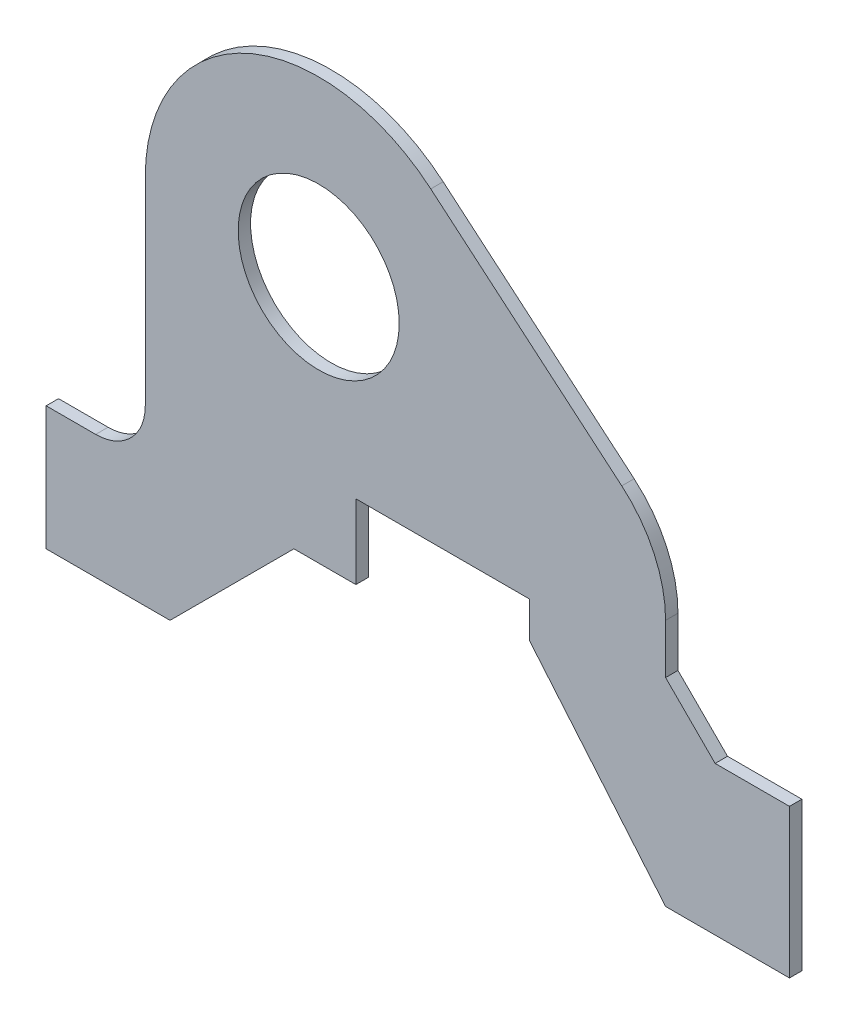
ISO-10303-21;
HEADER;
FILE_DESCRIPTION(('STEP AP214'),'2;1');
FILE_NAME('part.step','',(''),(''),'','','');
FILE_SCHEMA(('AUTOMOTIVE_DESIGN { 1 0 10303 214 1 1 1 1 }'));
ENDSEC;
DATA;
#1=APPLICATION_CONTEXT('core data for automotive mechanical design processes');
#2=APPLICATION_PROTOCOL_DEFINITION('international standard','automotive_design',2000,#1);
#3=PRODUCT_CONTEXT('',#1,'mechanical');
#4=PRODUCT('Part','Part','',(#3));
#5=PRODUCT_RELATED_PRODUCT_CATEGORY('part','',(#4));
#6=PRODUCT_DEFINITION_FORMATION('','',#4);
#7=PRODUCT_DEFINITION_CONTEXT('part definition',#1,'design');
#8=PRODUCT_DEFINITION('design','',#6,#7);
#9=PRODUCT_DEFINITION_SHAPE('','',#8);
#10=(LENGTH_UNIT() NAMED_UNIT(*) SI_UNIT(.MILLI.,.METRE.));
#11=(NAMED_UNIT(*) PLANE_ANGLE_UNIT() SI_UNIT($,.RADIAN.));
#12=(NAMED_UNIT(*) SI_UNIT($,.STERADIAN.) SOLID_ANGLE_UNIT());
#13=UNCERTAINTY_MEASURE_WITH_UNIT(LENGTH_MEASURE(1.E-05),#10,'distance_accuracy_value','');
#14=(GEOMETRIC_REPRESENTATION_CONTEXT(3) GLOBAL_UNCERTAINTY_ASSIGNED_CONTEXT((#13)) GLOBAL_UNIT_ASSIGNED_CONTEXT((#10,
#11,#12)) REPRESENTATION_CONTEXT('',''));
#15=CARTESIAN_POINT('',(0.,0.,0.));
#16=DIRECTION('',(0.,0.,1.));
#17=DIRECTION('',(1.,0.,0.));
#18=AXIS2_PLACEMENT_3D('',#15,#16,#17);
#19=CARTESIAN_POINT('',(4.,14.,1.));
#20=DIRECTION('',(0.,0.,1.));
#21=DIRECTION('',(1.,0.,0.));
#22=AXIS2_PLACEMENT_3D('',#19,#20,#21);
#23=PLANE('',#22);
#24=DIRECTION('',(1.,0.,0.));
#25=VECTOR('',#24,1.);
#26=CARTESIAN_POINT('',(10.,0.,1.));
#27=LINE('',#26,#25);
#28=CARTESIAN_POINT('',(0.,0.,1.));
#29=VERTEX_POINT('',#28);
#30=CARTESIAN_POINT('',(10.,0.,1.));
#31=VERTEX_POINT('',#30);
#32=EDGE_CURVE('E233',#29,#31,#27,.T.);
#33=ORIENTED_EDGE('',*,*,#32,.T.);
#34=DIRECTION('',(0.707106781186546,0.707106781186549,0.));
#35=VECTOR('',#34,1.);
#36=CARTESIAN_POINT('',(20.,10.,1.));
#37=LINE('',#36,#35);
#38=CARTESIAN_POINT('',(20.,10.,1.));
#39=VERTEX_POINT('',#38);
#40=EDGE_CURVE('E126',#31,#39,#37,.T.);
#41=ORIENTED_EDGE('',*,*,#40,.T.);
#42=DIRECTION('',(1.,0.,0.));
#43=VECTOR('',#42,1.);
#44=CARTESIAN_POINT('',(20.,10.,1.));
#45=LINE('',#44,#43);
#46=CARTESIAN_POINT('',(25.,10.,1.));
#47=VERTEX_POINT('',#46);
#48=EDGE_CURVE('E281',#39,#47,#45,.T.);
#49=ORIENTED_EDGE('',*,*,#48,.T.);
#50=DIRECTION('',(0.,1.,0.));
#51=VECTOR('',#50,1.);
#52=CARTESIAN_POINT('',(25.,10.,1.));
#53=LINE('',#52,#51);
#54=CARTESIAN_POINT('',(25.,16.,1.));
#55=VERTEX_POINT('',#54);
#56=EDGE_CURVE('E300',#47,#55,#53,.T.);
#57=ORIENTED_EDGE('',*,*,#56,.T.);
#58=DIRECTION('',(1.,0.,0.));
#59=VECTOR('',#58,1.);
#60=CARTESIAN_POINT('',(25.,16.,1.));
#61=LINE('',#60,#59);
#62=CARTESIAN_POINT('',(39.,16.,1.));
#63=VERTEX_POINT('',#62);
#64=EDGE_CURVE('E297',#55,#63,#61,.T.);
#65=ORIENTED_EDGE('',*,*,#64,.T.);
#66=DIRECTION('',(0.,-1.,0.));
#67=VECTOR('',#66,1.);
#68=CARTESIAN_POINT('',(39.,16.,1.));
#69=LINE('',#68,#67);
#70=CARTESIAN_POINT('',(39.,13.1092895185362,1.));
#71=VERTEX_POINT('',#70);
#72=EDGE_CURVE('E299',#63,#71,#69,.T.);
#73=ORIENTED_EDGE('',*,*,#72,.T.);
#74=DIRECTION('',(0.642787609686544,-0.766044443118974,0.));
#75=VECTOR('',#74,1.);
#76=CARTESIAN_POINT('',(39.,13.1092895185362,1.));
#77=LINE('',#76,#75);
#78=CARTESIAN_POINT('',(50.,0.,1.));
#79=VERTEX_POINT('',#78);
#80=EDGE_CURVE('E302',#71,#79,#77,.T.);
#81=ORIENTED_EDGE('',*,*,#80,.T.);
#82=DIRECTION('',(1.,0.,0.));
#83=VECTOR('',#82,1.);
#84=CARTESIAN_POINT('',(60.,0.,1.));
#85=LINE('',#84,#83);
#86=CARTESIAN_POINT('',(60.,0.,1.));
#87=VERTEX_POINT('',#86);
#88=EDGE_CURVE('E308',#79,#87,#85,.T.);
#89=ORIENTED_EDGE('',*,*,#88,.T.);
#90=DIRECTION('',(0.,1.,0.));
#91=VECTOR('',#90,1.);
#92=CARTESIAN_POINT('',(60.,12.,1.));
#93=LINE('',#92,#91);
#94=CARTESIAN_POINT('',(60.,12.,1.));
#95=VERTEX_POINT('',#94);
#96=EDGE_CURVE('E310',#87,#95,#93,.T.);
#97=ORIENTED_EDGE('',*,*,#96,.T.);
#98=DIRECTION('',(-1.,0.,0.));
#99=VECTOR('',#98,1.);
#100=CARTESIAN_POINT('',(54.,12.,1.));
#101=LINE('',#100,#99);
#102=CARTESIAN_POINT('',(54.,12.,1.));
#103=VERTEX_POINT('',#102);
#104=EDGE_CURVE('E312',#95,#103,#101,.T.);
#105=ORIENTED_EDGE('',*,*,#104,.T.);
#106=DIRECTION('',(-0.707106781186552,0.707106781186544,0.));
#107=VECTOR('',#106,1.);
#108=CARTESIAN_POINT('',(54.,12.,1.));
#109=LINE('',#108,#107);
#110=CARTESIAN_POINT('',(50.,16.,1.));
#111=VERTEX_POINT('',#110);
#112=EDGE_CURVE('E314',#103,#111,#109,.T.);
#113=ORIENTED_EDGE('',*,*,#112,.T.);
#114=DIRECTION('',(0.,1.,0.));
#115=VECTOR('',#114,1.);
#116=CARTESIAN_POINT('',(50.,16.,1.));
#117=LINE('',#116,#115);
#118=CARTESIAN_POINT('',(50.,20.,1.));
#119=VERTEX_POINT('',#118);
#120=EDGE_CURVE('E316',#111,#119,#117,.T.);
#121=ORIENTED_EDGE('',*,*,#120,.T.);
#122=CARTESIAN_POINT('',(40.,20.,1.));
#123=DIRECTION('',(0.,0.,1.));
#124=DIRECTION('',(1.,0.,0.));
#125=AXIS2_PLACEMENT_3D('',#122,#123,#124);
#126=CIRCLE('',#125,10.);
#127=CARTESIAN_POINT('',(46.4620306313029,27.6316551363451,1.));
#128=VERTEX_POINT('',#127);
#129=EDGE_CURVE('E318',#119,#128,#126,.T.);
#130=ORIENTED_EDGE('',*,*,#129,.T.);
#131=DIRECTION('',(-0.763165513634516,0.646203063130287,0.));
#132=VECTOR('',#131,1.);
#133=CARTESIAN_POINT('',(31.046842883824,40.6843171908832,1.));
#134=LINE('',#133,#132);
#135=CARTESIAN_POINT('',(31.046842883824,40.6843171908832,1.));
#136=VERTEX_POINT('',#135);
#137=EDGE_CURVE('E320',#128,#136,#134,.T.);
#138=ORIENTED_EDGE('',*,*,#137,.T.);
#139=CARTESIAN_POINT('',(22.,30.,1.));
#140=DIRECTION('',(0.,0.,1.));
#141=DIRECTION('',(-1.,0.,0.));
#142=AXIS2_PLACEMENT_3D('',#139,#140,#141);
#143=CIRCLE('',#142,14.);
#144=CARTESIAN_POINT('',(8.,30.,1.));
#145=VERTEX_POINT('',#144);
#146=EDGE_CURVE('E322',#136,#145,#143,.T.);
#147=ORIENTED_EDGE('',*,*,#146,.T.);
#148=DIRECTION('',(0.,-1.,0.));
#149=VECTOR('',#148,1.);
#150=CARTESIAN_POINT('',(8.,14.,1.));
#151=LINE('',#150,#149);
#152=CARTESIAN_POINT('',(8.,14.,1.));
#153=VERTEX_POINT('',#152);
#154=EDGE_CURVE('E178',#145,#153,#151,.T.);
#155=ORIENTED_EDGE('',*,*,#154,.T.);
#156=CARTESIAN_POINT('',(4.,14.,1.));
#157=DIRECTION('',(0.,0.,-1.));
#158=DIRECTION('',(1.,0.,0.));
#159=AXIS2_PLACEMENT_3D('',#156,#157,#158);
#160=CIRCLE('',#159,4.);
#161=CARTESIAN_POINT('',(4.,10.,1.));
#162=VERTEX_POINT('',#161);
#163=EDGE_CURVE('E172',#153,#162,#160,.T.);
#164=ORIENTED_EDGE('',*,*,#163,.T.);
#165=DIRECTION('',(-1.,0.,0.));
#166=VECTOR('',#165,1.);
#167=CARTESIAN_POINT('',(0.,10.,1.));
#168=LINE('',#167,#166);
#169=CARTESIAN_POINT('',(0.,10.,1.));
#170=VERTEX_POINT('',#169);
#171=EDGE_CURVE('E176',#162,#170,#168,.T.);
#172=ORIENTED_EDGE('',*,*,#171,.T.);
#173=DIRECTION('',(0.,-1.,0.));
#174=VECTOR('',#173,1.);
#175=CARTESIAN_POINT('',(0.,0.,1.));
#176=LINE('',#175,#174);
#177=EDGE_CURVE('E50',#170,#29,#176,.T.);
#178=ORIENTED_EDGE('',*,*,#177,.T.);
#179=EDGE_LOOP('',(#33,#41,#49,#57,#65,#73,#81,#89,#97,#105,#113,#121,#130,#138,#147,#155,#164,
#172,#178));
#180=FACE_BOUND('',#179,.T.);
#181=CARTESIAN_POINT('',(22.,30.,1.));
#182=DIRECTION('',(0.,0.,1.));
#183=DIRECTION('',(1.,0.,0.));
#184=AXIS2_PLACEMENT_3D('',#181,#182,#183);
#185=CIRCLE('',#184,6.50000000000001);
#186=CARTESIAN_POINT('',(28.5,30.,1.));
#187=VERTEX_POINT('',#186);
#188=EDGE_CURVE('E200',#187,#187,#185,.T.);
#189=ORIENTED_EDGE('',*,*,#188,.F.);
#190=EDGE_LOOP('',(#189));
#191=FACE_BOUND('',#190,.T.);
#192=ADVANCED_FACE('F33',(#180,#191),#23,.T.);
#193=CARTESIAN_POINT('',(4.,14.,0.));
#194=DIRECTION('',(0.,0.,1.));
#195=DIRECTION('',(1.,0.,0.));
#196=AXIS2_PLACEMENT_3D('',#193,#194,#195);
#197=PLANE('',#196);
#198=DIRECTION('',(1.,0.,0.));
#199=VECTOR('',#198,1.);
#200=CARTESIAN_POINT('',(10.,0.,0.));
#201=LINE('',#200,#199);
#202=CARTESIAN_POINT('',(0.,0.,0.));
#203=VERTEX_POINT('',#202);
#204=CARTESIAN_POINT('',(10.,0.,0.));
#205=VERTEX_POINT('',#204);
#206=EDGE_CURVE('E196',#203,#205,#201,.T.);
#207=ORIENTED_EDGE('',*,*,#206,.F.);
#208=DIRECTION('',(0.,-1.,0.));
#209=VECTOR('',#208,1.);
#210=CARTESIAN_POINT('',(0.,0.,0.));
#211=LINE('',#210,#209);
#212=CARTESIAN_POINT('',(0.,10.,0.));
#213=VERTEX_POINT('',#212);
#214=EDGE_CURVE('E118',#213,#203,#211,.T.);
#215=ORIENTED_EDGE('',*,*,#214,.F.);
#216=DIRECTION('',(-1.,0.,0.));
#217=VECTOR('',#216,1.);
#218=CARTESIAN_POINT('',(0.,10.,0.));
#219=LINE('',#218,#217);
#220=CARTESIAN_POINT('',(4.,10.,0.));
#221=VERTEX_POINT('',#220);
#222=EDGE_CURVE('E112',#221,#213,#219,.T.);
#223=ORIENTED_EDGE('',*,*,#222,.F.);
#224=CARTESIAN_POINT('',(4.,14.,0.));
#225=DIRECTION('',(0.,0.,-1.));
#226=DIRECTION('',(1.,0.,0.));
#227=AXIS2_PLACEMENT_3D('',#224,#225,#226);
#228=CIRCLE('',#227,4.);
#229=CARTESIAN_POINT('',(8.,14.,0.));
#230=VERTEX_POINT('',#229);
#231=EDGE_CURVE('E186',#230,#221,#228,.T.);
#232=ORIENTED_EDGE('',*,*,#231,.F.);
#233=DIRECTION('',(0.,-1.,0.));
#234=VECTOR('',#233,1.);
#235=CARTESIAN_POINT('',(8.,14.,0.));
#236=LINE('',#235,#234);
#237=CARTESIAN_POINT('',(8.,30.,0.));
#238=VERTEX_POINT('',#237);
#239=EDGE_CURVE('E228',#238,#230,#236,.T.);
#240=ORIENTED_EDGE('',*,*,#239,.F.);
#241=CARTESIAN_POINT('',(22.,30.,0.));
#242=DIRECTION('',(0.,0.,1.));
#243=DIRECTION('',(-1.,0.,0.));
#244=AXIS2_PLACEMENT_3D('',#241,#242,#243);
#245=CIRCLE('',#244,14.);
#246=CARTESIAN_POINT('',(31.046842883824,40.6843171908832,0.));
#247=VERTEX_POINT('',#246);
#248=EDGE_CURVE('E226',#247,#238,#245,.T.);
#249=ORIENTED_EDGE('',*,*,#248,.F.);
#250=DIRECTION('',(-0.763165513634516,0.646203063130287,0.));
#251=VECTOR('',#250,1.);
#252=CARTESIAN_POINT('',(31.046842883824,40.6843171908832,0.));
#253=LINE('',#252,#251);
#254=CARTESIAN_POINT('',(46.4620306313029,27.6316551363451,0.));
#255=VERTEX_POINT('',#254);
#256=EDGE_CURVE('E224',#255,#247,#253,.T.);
#257=ORIENTED_EDGE('',*,*,#256,.F.);
#258=CARTESIAN_POINT('',(40.,20.,0.));
#259=DIRECTION('',(0.,0.,1.));
#260=DIRECTION('',(1.,0.,0.));
#261=AXIS2_PLACEMENT_3D('',#258,#259,#260);
#262=CIRCLE('',#261,10.);
#263=CARTESIAN_POINT('',(50.,20.,0.));
#264=VERTEX_POINT('',#263);
#265=EDGE_CURVE('E222',#264,#255,#262,.T.);
#266=ORIENTED_EDGE('',*,*,#265,.F.);
#267=DIRECTION('',(0.,1.,0.));
#268=VECTOR('',#267,1.);
#269=CARTESIAN_POINT('',(50.,16.,0.));
#270=LINE('',#269,#268);
#271=CARTESIAN_POINT('',(50.,16.,0.));
#272=VERTEX_POINT('',#271);
#273=EDGE_CURVE('E220',#272,#264,#270,.T.);
#274=ORIENTED_EDGE('',*,*,#273,.F.);
#275=DIRECTION('',(-0.707106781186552,0.707106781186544,0.));
#276=VECTOR('',#275,1.);
#277=CARTESIAN_POINT('',(54.,12.,0.));
#278=LINE('',#277,#276);
#279=CARTESIAN_POINT('',(54.,12.,0.));
#280=VERTEX_POINT('',#279);
#281=EDGE_CURVE('E218',#280,#272,#278,.T.);
#282=ORIENTED_EDGE('',*,*,#281,.F.);
#283=DIRECTION('',(-1.,0.,0.));
#284=VECTOR('',#283,1.);
#285=CARTESIAN_POINT('',(54.,12.,0.));
#286=LINE('',#285,#284);
#287=CARTESIAN_POINT('',(60.,12.,0.));
#288=VERTEX_POINT('',#287);
#289=EDGE_CURVE('E216',#288,#280,#286,.T.);
#290=ORIENTED_EDGE('',*,*,#289,.F.);
#291=DIRECTION('',(0.,1.,0.));
#292=VECTOR('',#291,1.);
#293=CARTESIAN_POINT('',(60.,12.,0.));
#294=LINE('',#293,#292);
#295=CARTESIAN_POINT('',(60.,0.,0.));
#296=VERTEX_POINT('',#295);
#297=EDGE_CURVE('E214',#296,#288,#294,.T.);
#298=ORIENTED_EDGE('',*,*,#297,.F.);
#299=DIRECTION('',(1.,0.,0.));
#300=VECTOR('',#299,1.);
#301=CARTESIAN_POINT('',(60.,0.,0.));
#302=LINE('',#301,#300);
#303=CARTESIAN_POINT('',(50.,0.,0.));
#304=VERTEX_POINT('',#303);
#305=EDGE_CURVE('E212',#304,#296,#302,.T.);
#306=ORIENTED_EDGE('',*,*,#305,.F.);
#307=DIRECTION('',(0.642787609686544,-0.766044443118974,0.));
#308=VECTOR('',#307,1.);
#309=CARTESIAN_POINT('',(39.,13.1092895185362,0.));
#310=LINE('',#309,#308);
#311=CARTESIAN_POINT('',(39.,13.1092895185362,0.));
#312=VERTEX_POINT('',#311);
#313=EDGE_CURVE('E210',#312,#304,#310,.T.);
#314=ORIENTED_EDGE('',*,*,#313,.F.);
#315=DIRECTION('',(0.,-1.,0.));
#316=VECTOR('',#315,1.);
#317=CARTESIAN_POINT('',(39.,16.,0.));
#318=LINE('',#317,#316);
#319=CARTESIAN_POINT('',(39.,16.,0.));
#320=VERTEX_POINT('',#319);
#321=EDGE_CURVE('E208',#320,#312,#318,.T.);
#322=ORIENTED_EDGE('',*,*,#321,.F.);
#323=DIRECTION('',(1.,0.,0.));
#324=VECTOR('',#323,1.);
#325=CARTESIAN_POINT('',(25.,16.,0.));
#326=LINE('',#325,#324);
#327=CARTESIAN_POINT('',(25.,16.,0.));
#328=VERTEX_POINT('',#327);
#329=EDGE_CURVE('E206',#328,#320,#326,.T.);
#330=ORIENTED_EDGE('',*,*,#329,.F.);
#331=DIRECTION('',(0.,1.,0.));
#332=VECTOR('',#331,1.);
#333=CARTESIAN_POINT('',(25.,10.,0.));
#334=LINE('',#333,#332);
#335=CARTESIAN_POINT('',(25.,10.,0.));
#336=VERTEX_POINT('',#335);
#337=EDGE_CURVE('E204',#336,#328,#334,.T.);
#338=ORIENTED_EDGE('',*,*,#337,.F.);
#339=DIRECTION('',(1.,0.,0.));
#340=VECTOR('',#339,1.);
#341=CARTESIAN_POINT('',(20.,10.,0.));
#342=LINE('',#341,#340);
#343=CARTESIAN_POINT('',(20.,10.,0.));
#344=VERTEX_POINT('',#343);
#345=EDGE_CURVE('E202',#344,#336,#342,.T.);
#346=ORIENTED_EDGE('',*,*,#345,.F.);
#347=DIRECTION('',(0.707106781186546,0.707106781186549,0.));
#348=VECTOR('',#347,1.);
#349=CARTESIAN_POINT('',(20.,10.,0.));
#350=LINE('',#349,#348);
#351=EDGE_CURVE('E199',#205,#344,#350,.T.);
#352=ORIENTED_EDGE('',*,*,#351,.F.);
#353=EDGE_LOOP('',(#207,#215,#223,#232,#240,#249,#257,#266,#274,#282,#290,#298,#306,#314,#322,
#330,#338,#346,#352));
#354=FACE_BOUND('',#353,.T.);
#355=CARTESIAN_POINT('',(22.,30.,0.));
#356=DIRECTION('',(0.,0.,1.));
#357=DIRECTION('',(1.,0.,0.));
#358=AXIS2_PLACEMENT_3D('',#355,#356,#357);
#359=CIRCLE('',#358,6.50000000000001);
#360=CARTESIAN_POINT('',(28.5,30.,0.));
#361=VERTEX_POINT('',#360);
#362=EDGE_CURVE('E560',#361,#361,#359,.T.);
#363=ORIENTED_EDGE('',*,*,#362,.T.);
#364=EDGE_LOOP('',(#363));
#365=FACE_BOUND('',#364,.T.);
#366=ADVANCED_FACE('F285',(#354,#365),#197,.F.);
#367=CARTESIAN_POINT('',(10.,0.,1.));
#368=DIRECTION('',(0.,1.,0.));
#369=DIRECTION('',(-1.,0.,0.));
#370=AXIS2_PLACEMENT_3D('',#367,#368,#369);
#371=PLANE('',#370);
#372=ORIENTED_EDGE('',*,*,#206,.T.);
#373=DIRECTION('',(0.,0.,-1.));
#374=VECTOR('',#373,1.);
#375=CARTESIAN_POINT('',(10.,0.,1.));
#376=LINE('',#375,#374);
#377=EDGE_CURVE('E11',#31,#205,#376,.T.);
#378=ORIENTED_EDGE('',*,*,#377,.F.);
#379=ORIENTED_EDGE('',*,*,#32,.F.);
#380=DIRECTION('',(0.,0.,-1.));
#381=VECTOR('',#380,1.);
#382=CARTESIAN_POINT('',(0.,0.,1.));
#383=LINE('',#382,#381);
#384=EDGE_CURVE('E192',#29,#203,#383,.T.);
#385=ORIENTED_EDGE('',*,*,#384,.T.);
#386=EDGE_LOOP('',(#372,#378,#379,#385));
#387=FACE_BOUND('',#386,.T.);
#388=ADVANCED_FACE('F35',(#387),#371,.F.);
#389=CARTESIAN_POINT('',(20.,10.,1.));
#390=DIRECTION('',(-0.707106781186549,0.707106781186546,0.));
#391=DIRECTION('',(-0.707106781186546,-0.707106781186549,0.));
#392=AXIS2_PLACEMENT_3D('',#389,#390,#391);
#393=PLANE('',#392);
#394=ORIENTED_EDGE('',*,*,#351,.T.);
#395=DIRECTION('',(0.,0.,-1.));
#396=VECTOR('',#395,1.);
#397=CARTESIAN_POINT('',(20.,10.,1.));
#398=LINE('',#397,#396);
#399=EDGE_CURVE('E42',#39,#344,#398,.T.);
#400=ORIENTED_EDGE('',*,*,#399,.F.);
#401=ORIENTED_EDGE('',*,*,#40,.F.);
#402=ORIENTED_EDGE('',*,*,#377,.T.);
#403=EDGE_LOOP('',(#394,#400,#401,#402));
#404=FACE_BOUND('',#403,.T.);
#405=ADVANCED_FACE('F356',(#404),#393,.F.);
#406=CARTESIAN_POINT('',(20.,10.,1.));
#407=DIRECTION('',(0.,1.,0.));
#408=DIRECTION('',(0.,0.,1.));
#409=AXIS2_PLACEMENT_3D('',#406,#407,#408);
#410=PLANE('',#409);
#411=ORIENTED_EDGE('',*,*,#345,.T.);
#412=DIRECTION('',(0.,0.,-1.));
#413=VECTOR('',#412,1.);
#414=CARTESIAN_POINT('',(25.,10.,1.));
#415=LINE('',#414,#413);
#416=EDGE_CURVE('E273',#47,#336,#415,.T.);
#417=ORIENTED_EDGE('',*,*,#416,.F.);
#418=ORIENTED_EDGE('',*,*,#48,.F.);
#419=ORIENTED_EDGE('',*,*,#399,.T.);
#420=EDGE_LOOP('',(#411,#417,#418,#419));
#421=FACE_BOUND('',#420,.T.);
#422=ADVANCED_FACE('F279',(#421),#410,.F.);
#423=CARTESIAN_POINT('',(25.,10.,1.));
#424=DIRECTION('',(-1.,0.,0.));
#425=DIRECTION('',(0.,0.,1.));
#426=AXIS2_PLACEMENT_3D('',#423,#424,#425);
#427=PLANE('',#426);
#428=ORIENTED_EDGE('',*,*,#337,.T.);
#429=DIRECTION('',(0.,0.,-1.));
#430=VECTOR('',#429,1.);
#431=CARTESIAN_POINT('',(25.,16.,1.));
#432=LINE('',#431,#430);
#433=EDGE_CURVE('E270',#55,#328,#432,.T.);
#434=ORIENTED_EDGE('',*,*,#433,.F.);
#435=ORIENTED_EDGE('',*,*,#56,.F.);
#436=ORIENTED_EDGE('',*,*,#416,.T.);
#437=EDGE_LOOP('',(#428,#434,#435,#436));
#438=FACE_BOUND('',#437,.T.);
#439=ADVANCED_FACE('F291',(#438),#427,.F.);
#440=CARTESIAN_POINT('',(25.,16.,1.));
#441=DIRECTION('',(0.,1.,0.));
#442=DIRECTION('',(0.,0.,1.));
#443=AXIS2_PLACEMENT_3D('',#440,#441,#442);
#444=PLANE('',#443);
#445=ORIENTED_EDGE('',*,*,#329,.T.);
#446=DIRECTION('',(0.,0.,-1.));
#447=VECTOR('',#446,1.);
#448=CARTESIAN_POINT('',(39.,16.,1.));
#449=LINE('',#448,#447);
#450=EDGE_CURVE('E267',#63,#320,#449,.T.);
#451=ORIENTED_EDGE('',*,*,#450,.F.);
#452=ORIENTED_EDGE('',*,*,#64,.F.);
#453=ORIENTED_EDGE('',*,*,#433,.T.);
#454=EDGE_LOOP('',(#445,#451,#452,#453));
#455=FACE_BOUND('',#454,.T.);
#456=ADVANCED_FACE('F295',(#455),#444,.F.);
#457=CARTESIAN_POINT('',(39.,16.,1.));
#458=DIRECTION('',(1.,0.,0.));
#459=DIRECTION('',(0.,0.,-1.));
#460=AXIS2_PLACEMENT_3D('',#457,#458,#459);
#461=PLANE('',#460);
#462=ORIENTED_EDGE('',*,*,#321,.T.);
#463=DIRECTION('',(0.,0.,-1.));
#464=VECTOR('',#463,1.);
#465=CARTESIAN_POINT('',(39.,13.1092895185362,1.));
#466=LINE('',#465,#464);
#467=EDGE_CURVE('E264',#71,#312,#466,.T.);
#468=ORIENTED_EDGE('',*,*,#467,.F.);
#469=ORIENTED_EDGE('',*,*,#72,.F.);
#470=ORIENTED_EDGE('',*,*,#450,.T.);
#471=EDGE_LOOP('',(#462,#468,#469,#470));
#472=FACE_BOUND('',#471,.T.);
#473=ADVANCED_FACE('F369',(#472),#461,.F.);
#474=CARTESIAN_POINT('',(39.,13.1092895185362,1.));
#475=DIRECTION('',(0.766044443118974,0.642787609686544,0.));
#476=DIRECTION('',(-0.642787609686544,0.766044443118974,0.));
#477=AXIS2_PLACEMENT_3D('',#474,#475,#476);
#478=PLANE('',#477);
#479=ORIENTED_EDGE('',*,*,#313,.T.);
#480=DIRECTION('',(0.,0.,-1.));
#481=VECTOR('',#480,1.);
#482=CARTESIAN_POINT('',(50.,0.,1.));
#483=LINE('',#482,#481);
#484=EDGE_CURVE('E261',#79,#304,#483,.T.);
#485=ORIENTED_EDGE('',*,*,#484,.F.);
#486=ORIENTED_EDGE('',*,*,#80,.F.);
#487=ORIENTED_EDGE('',*,*,#467,.T.);
#488=EDGE_LOOP('',(#479,#485,#486,#487));
#489=FACE_BOUND('',#488,.T.);
#490=ADVANCED_FACE('F372',(#489),#478,.F.);
#491=CARTESIAN_POINT('',(60.,0.,1.));
#492=DIRECTION('',(0.,1.,0.));
#493=DIRECTION('',(-1.,0.,0.));
#494=AXIS2_PLACEMENT_3D('',#491,#492,#493);
#495=PLANE('',#494);
#496=ORIENTED_EDGE('',*,*,#305,.T.);
#497=DIRECTION('',(0.,0.,-1.));
#498=VECTOR('',#497,1.);
#499=CARTESIAN_POINT('',(60.,0.,1.));
#500=LINE('',#499,#498);
#501=EDGE_CURVE('E258',#87,#296,#500,.T.);
#502=ORIENTED_EDGE('',*,*,#501,.F.);
#503=ORIENTED_EDGE('',*,*,#88,.F.);
#504=ORIENTED_EDGE('',*,*,#484,.T.);
#505=EDGE_LOOP('',(#496,#502,#503,#504));
#506=FACE_BOUND('',#505,.T.);
#507=ADVANCED_FACE('F376',(#506),#495,.F.);
#508=CARTESIAN_POINT('',(60.,12.,1.));
#509=DIRECTION('',(-1.,0.,0.));
#510=DIRECTION('',(0.,0.,1.));
#511=AXIS2_PLACEMENT_3D('',#508,#509,#510);
#512=PLANE('',#511);
#513=ORIENTED_EDGE('',*,*,#297,.T.);
#514=DIRECTION('',(0.,0.,-1.));
#515=VECTOR('',#514,1.);
#516=CARTESIAN_POINT('',(60.,12.,1.));
#517=LINE('',#516,#515);
#518=EDGE_CURVE('E255',#95,#288,#517,.T.);
#519=ORIENTED_EDGE('',*,*,#518,.F.);
#520=ORIENTED_EDGE('',*,*,#96,.F.);
#521=ORIENTED_EDGE('',*,*,#501,.T.);
#522=EDGE_LOOP('',(#513,#519,#520,#521));
#523=FACE_BOUND('',#522,.T.);
#524=ADVANCED_FACE('F380',(#523),#512,.F.);
#525=CARTESIAN_POINT('',(54.,12.,1.));
#526=DIRECTION('',(0.,-1.,0.));
#527=DIRECTION('',(0.,0.,-1.));
#528=AXIS2_PLACEMENT_3D('',#525,#526,#527);
#529=PLANE('',#528);
#530=ORIENTED_EDGE('',*,*,#289,.T.);
#531=DIRECTION('',(0.,0.,-1.));
#532=VECTOR('',#531,1.);
#533=CARTESIAN_POINT('',(54.,12.,1.));
#534=LINE('',#533,#532);
#535=EDGE_CURVE('E252',#103,#280,#534,.T.);
#536=ORIENTED_EDGE('',*,*,#535,.F.);
#537=ORIENTED_EDGE('',*,*,#104,.F.);
#538=ORIENTED_EDGE('',*,*,#518,.T.);
#539=EDGE_LOOP('',(#530,#536,#537,#538));
#540=FACE_BOUND('',#539,.T.);
#541=ADVANCED_FACE('F384',(#540),#529,.F.);
#542=CARTESIAN_POINT('',(54.,12.,1.));
#543=DIRECTION('',(-0.707106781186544,-0.707106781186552,0.));
#544=DIRECTION('',(0.707106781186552,-0.707106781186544,0.));
#545=AXIS2_PLACEMENT_3D('',#542,#543,#544);
#546=PLANE('',#545);
#547=ORIENTED_EDGE('',*,*,#281,.T.);
#548=DIRECTION('',(0.,0.,-1.));
#549=VECTOR('',#548,1.);
#550=CARTESIAN_POINT('',(50.,16.,1.));
#551=LINE('',#550,#549);
#552=EDGE_CURVE('E249',#111,#272,#551,.T.);
#553=ORIENTED_EDGE('',*,*,#552,.F.);
#554=ORIENTED_EDGE('',*,*,#112,.F.);
#555=ORIENTED_EDGE('',*,*,#535,.T.);
#556=EDGE_LOOP('',(#547,#553,#554,#555));
#557=FACE_BOUND('',#556,.T.);
#558=ADVANCED_FACE('F388',(#557),#546,.F.);
#559=CARTESIAN_POINT('',(50.,16.,1.));
#560=DIRECTION('',(-1.,0.,0.));
#561=DIRECTION('',(0.,-1.,0.));
#562=AXIS2_PLACEMENT_3D('',#559,#560,#561);
#563=PLANE('',#562);
#564=ORIENTED_EDGE('',*,*,#273,.T.);
#565=DIRECTION('',(0.,0.,-1.));
#566=VECTOR('',#565,1.);
#567=CARTESIAN_POINT('',(50.,20.,1.));
#568=LINE('',#567,#566);
#569=EDGE_CURVE('E246',#119,#264,#568,.T.);
#570=ORIENTED_EDGE('',*,*,#569,.F.);
#571=ORIENTED_EDGE('',*,*,#120,.F.);
#572=ORIENTED_EDGE('',*,*,#552,.T.);
#573=EDGE_LOOP('',(#564,#570,#571,#572));
#574=FACE_BOUND('',#573,.T.);
#575=ADVANCED_FACE('F392',(#574),#563,.F.);
#576=CARTESIAN_POINT('',(40.,20.,1.));
#577=DIRECTION('',(0.,0.,-1.));
#578=DIRECTION('',(-1.,0.,0.));
#579=AXIS2_PLACEMENT_3D('',#576,#577,#578);
#580=CYLINDRICAL_SURFACE('',#579,10.);
#581=ORIENTED_EDGE('',*,*,#265,.T.);
#582=DIRECTION('',(0.,0.,-1.));
#583=VECTOR('',#582,1.);
#584=CARTESIAN_POINT('',(46.4620306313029,27.6316551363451,1.));
#585=LINE('',#584,#583);
#586=EDGE_CURVE('E243',#128,#255,#585,.T.);
#587=ORIENTED_EDGE('',*,*,#586,.F.);
#588=ORIENTED_EDGE('',*,*,#129,.F.);
#589=ORIENTED_EDGE('',*,*,#569,.T.);
#590=EDGE_LOOP('',(#581,#587,#588,#589));
#591=FACE_BOUND('',#590,.T.);
#592=ADVANCED_FACE('F396',(#591),#580,.T.);
#593=CARTESIAN_POINT('',(31.046842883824,40.6843171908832,1.));
#594=DIRECTION('',(-0.646203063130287,-0.763165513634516,0.));
#595=DIRECTION('',(0.763165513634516,-0.646203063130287,0.));
#596=AXIS2_PLACEMENT_3D('',#593,#594,#595);
#597=PLANE('',#596);
#598=ORIENTED_EDGE('',*,*,#256,.T.);
#599=DIRECTION('',(0.,0.,-1.));
#600=VECTOR('',#599,1.);
#601=CARTESIAN_POINT('',(31.046842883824,40.6843171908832,1.));
#602=LINE('',#601,#600);
#603=EDGE_CURVE('E240',#136,#247,#602,.T.);
#604=ORIENTED_EDGE('',*,*,#603,.F.);
#605=ORIENTED_EDGE('',*,*,#137,.F.);
#606=ORIENTED_EDGE('',*,*,#586,.T.);
#607=EDGE_LOOP('',(#598,#604,#605,#606));
#608=FACE_BOUND('',#607,.T.);
#609=ADVANCED_FACE('F400',(#608),#597,.F.);
#610=CARTESIAN_POINT('',(22.,30.,1.));
#611=DIRECTION('',(0.,0.,-1.));
#612=DIRECTION('',(-1.,0.,0.));
#613=AXIS2_PLACEMENT_3D('',#610,#611,#612);
#614=CYLINDRICAL_SURFACE('',#613,14.);
#615=ORIENTED_EDGE('',*,*,#248,.T.);
#616=DIRECTION('',(0.,0.,-1.));
#617=VECTOR('',#616,1.);
#618=CARTESIAN_POINT('',(8.,30.,1.));
#619=LINE('',#618,#617);
#620=EDGE_CURVE('E237',#145,#238,#619,.T.);
#621=ORIENTED_EDGE('',*,*,#620,.F.);
#622=ORIENTED_EDGE('',*,*,#146,.F.);
#623=ORIENTED_EDGE('',*,*,#603,.T.);
#624=EDGE_LOOP('',(#615,#621,#622,#623));
#625=FACE_BOUND('',#624,.T.);
#626=ADVANCED_FACE('F328',(#625),#614,.T.);
#627=CARTESIAN_POINT('',(8.,14.,1.));
#628=DIRECTION('',(1.,0.,0.));
#629=DIRECTION('',(0.,0.,-1.));
#630=AXIS2_PLACEMENT_3D('',#627,#628,#629);
#631=PLANE('',#630);
#632=ORIENTED_EDGE('',*,*,#239,.T.);
#633=DIRECTION('',(0.,0.,-1.));
#634=VECTOR('',#633,1.);
#635=CARTESIAN_POINT('',(8.,14.,1.));
#636=LINE('',#635,#634);
#637=EDGE_CURVE('E187',#153,#230,#636,.T.);
#638=ORIENTED_EDGE('',*,*,#637,.F.);
#639=ORIENTED_EDGE('',*,*,#154,.F.);
#640=ORIENTED_EDGE('',*,*,#620,.T.);
#641=EDGE_LOOP('',(#632,#638,#639,#640));
#642=FACE_BOUND('',#641,.T.);
#643=ADVANCED_FACE('F332',(#642),#631,.F.);
#644=CARTESIAN_POINT('',(4.,14.,1.));
#645=DIRECTION('',(0.,0.,-1.));
#646=DIRECTION('',(-1.,0.,0.));
#647=AXIS2_PLACEMENT_3D('',#644,#645,#646);
#648=CYLINDRICAL_SURFACE('',#647,4.);
#649=ORIENTED_EDGE('',*,*,#231,.T.);
#650=DIRECTION('',(0.,0.,-1.));
#651=VECTOR('',#650,1.);
#652=CARTESIAN_POINT('',(4.,10.,1.));
#653=LINE('',#652,#651);
#654=EDGE_CURVE('E183',#162,#221,#653,.T.);
#655=ORIENTED_EDGE('',*,*,#654,.F.);
#656=ORIENTED_EDGE('',*,*,#163,.F.);
#657=ORIENTED_EDGE('',*,*,#637,.T.);
#658=EDGE_LOOP('',(#649,#655,#656,#657));
#659=FACE_BOUND('',#658,.T.);
#660=ADVANCED_FACE('F184',(#659),#648,.F.);
#661=CARTESIAN_POINT('',(0.,10.,1.));
#662=DIRECTION('',(0.,-1.,0.));
#663=DIRECTION('',(1.,0.,0.));
#664=AXIS2_PLACEMENT_3D('',#661,#662,#663);
#665=PLANE('',#664);
#666=ORIENTED_EDGE('',*,*,#222,.T.);
#667=DIRECTION('',(0.,0.,-1.));
#668=VECTOR('',#667,1.);
#669=CARTESIAN_POINT('',(0.,10.,1.));
#670=LINE('',#669,#668);
#671=EDGE_CURVE('E188',#170,#213,#670,.T.);
#672=ORIENTED_EDGE('',*,*,#671,.F.);
#673=ORIENTED_EDGE('',*,*,#171,.F.);
#674=ORIENTED_EDGE('',*,*,#654,.T.);
#675=EDGE_LOOP('',(#666,#672,#673,#674));
#676=FACE_BOUND('',#675,.T.);
#677=ADVANCED_FACE('F190',(#676),#665,.F.);
#678=CARTESIAN_POINT('',(0.,0.,1.));
#679=DIRECTION('',(1.,0.,0.));
#680=DIRECTION('',(0.,0.,-1.));
#681=AXIS2_PLACEMENT_3D('',#678,#679,#680);
#682=PLANE('',#681);
#683=ORIENTED_EDGE('',*,*,#214,.T.);
#684=ORIENTED_EDGE('',*,*,#384,.F.);
#685=ORIENTED_EDGE('',*,*,#177,.F.);
#686=ORIENTED_EDGE('',*,*,#671,.T.);
#687=EDGE_LOOP('',(#683,#684,#685,#686));
#688=FACE_BOUND('',#687,.T.);
#689=ADVANCED_FACE('F336',(#688),#682,.F.);
#690=CARTESIAN_POINT('',(22.,30.,1.));
#691=DIRECTION('',(0.,0.,-1.));
#692=DIRECTION('',(-1.,0.,0.));
#693=AXIS2_PLACEMENT_3D('',#690,#691,#692);
#694=CYLINDRICAL_SURFACE('',#693,6.50000000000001);
#695=ORIENTED_EDGE('',*,*,#188,.T.);
#696=EDGE_LOOP('',(#695));
#697=FACE_BOUND('',#696,.T.);
#698=ORIENTED_EDGE('',*,*,#362,.F.);
#699=EDGE_LOOP('',(#698));
#700=FACE_BOUND('',#699,.T.);
#701=ADVANCED_FACE('F338',(#697,#700),#694,.F.);
#702=CLOSED_SHELL('',(#192,#366,#388,#405,#422,#439,#456,#473,#490,#507,#524,#541,#558,#575,
#592,#609,#626,#643,#660,#677,#689,#701));
#703=MANIFOLD_SOLID_BREP('B2',#702);
#704=ADVANCED_BREP_SHAPE_REPRESENTATION('',(#18,#703),#14);
#705=SHAPE_DEFINITION_REPRESENTATION(#9,#704);
ENDSEC;
END-ISO-10303-21;
